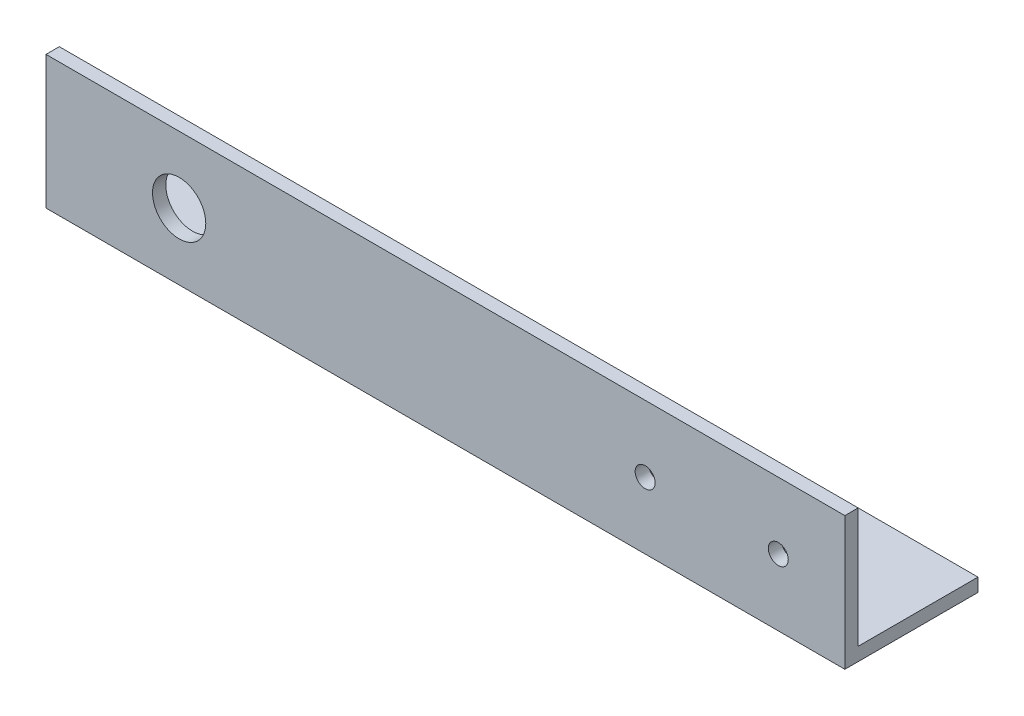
ISO-10303-21;
HEADER;
FILE_DESCRIPTION(('STEP AP214'),'2;1');
FILE_NAME('part.step','',(''),(''),'','','');
FILE_SCHEMA(('AUTOMOTIVE_DESIGN { 1 0 10303 214 1 1 1 1 }'));
ENDSEC;
DATA;
#1=APPLICATION_CONTEXT('core data for automotive mechanical design processes');
#2=APPLICATION_PROTOCOL_DEFINITION('international standard','automotive_design',2000,#1);
#3=PRODUCT_CONTEXT('',#1,'mechanical');
#4=PRODUCT('Part','Part','',(#3));
#5=PRODUCT_RELATED_PRODUCT_CATEGORY('part','',(#4));
#6=PRODUCT_DEFINITION_FORMATION('','',#4);
#7=PRODUCT_DEFINITION_CONTEXT('part definition',#1,'design');
#8=PRODUCT_DEFINITION('design','',#6,#7);
#9=PRODUCT_DEFINITION_SHAPE('','',#8);
#10=(LENGTH_UNIT() NAMED_UNIT(*) SI_UNIT(.MILLI.,.METRE.));
#11=(NAMED_UNIT(*) PLANE_ANGLE_UNIT() SI_UNIT($,.RADIAN.));
#12=(NAMED_UNIT(*) SI_UNIT($,.STERADIAN.) SOLID_ANGLE_UNIT());
#13=UNCERTAINTY_MEASURE_WITH_UNIT(LENGTH_MEASURE(1.E-05),#10,'distance_accuracy_value','');
#14=(GEOMETRIC_REPRESENTATION_CONTEXT(3) GLOBAL_UNCERTAINTY_ASSIGNED_CONTEXT((#13)) GLOBAL_UNIT_ASSIGNED_CONTEXT((#10,
#11,#12)) REPRESENTATION_CONTEXT('',''));
#15=CARTESIAN_POINT('',(0.,0.,0.));
#16=DIRECTION('',(0.,0.,1.));
#17=DIRECTION('',(1.,0.,0.));
#18=AXIS2_PLACEMENT_3D('',#15,#16,#17);
#19=CARTESIAN_POINT('',(120.,0.,-20.));
#20=DIRECTION('',(0.,1.,0.));
#21=DIRECTION('',(0.,0.,1.));
#22=AXIS2_PLACEMENT_3D('',#19,#20,#21);
#23=PLANE('',#22);
#24=DIRECTION('',(0.,0.,-1.));
#25=VECTOR('',#24,1.);
#26=CARTESIAN_POINT('',(0.,0.,-20.));
#27=LINE('',#26,#25);
#28=CARTESIAN_POINT('',(0.,0.,0.));
#29=VERTEX_POINT('',#28);
#30=CARTESIAN_POINT('',(0.,0.,-20.));
#31=VERTEX_POINT('',#30);
#32=EDGE_CURVE('E115',#29,#31,#27,.T.);
#33=ORIENTED_EDGE('',*,*,#32,.T.);
#34=DIRECTION('',(-1.,0.,0.));
#35=VECTOR('',#34,1.);
#36=CARTESIAN_POINT('',(120.,0.,-20.));
#37=LINE('',#36,#35);
#38=CARTESIAN_POINT('',(120.,0.,-20.));
#39=VERTEX_POINT('',#38);
#40=EDGE_CURVE('E11',#39,#31,#37,.T.);
#41=ORIENTED_EDGE('',*,*,#40,.F.);
#42=DIRECTION('',(0.,0.,-1.));
#43=VECTOR('',#42,1.);
#44=CARTESIAN_POINT('',(120.,0.,-20.));
#45=LINE('',#44,#43);
#46=CARTESIAN_POINT('',(120.,0.,0.));
#47=VERTEX_POINT('',#46);
#48=EDGE_CURVE('E126',#47,#39,#45,.T.);
#49=ORIENTED_EDGE('',*,*,#48,.F.);
#50=DIRECTION('',(-1.,0.,0.));
#51=VECTOR('',#50,1.);
#52=CARTESIAN_POINT('',(120.,0.,0.));
#53=LINE('',#52,#51);
#54=EDGE_CURVE('E111',#47,#29,#53,.T.);
#55=ORIENTED_EDGE('',*,*,#54,.T.);
#56=EDGE_LOOP('',(#33,#41,#49,#55));
#57=FACE_BOUND('',#56,.T.);
#58=ADVANCED_FACE('F31',(#57),#23,.F.);
#59=CARTESIAN_POINT('',(120.,2.,-20.));
#60=DIRECTION('',(0.,0.,1.));
#61=DIRECTION('',(1.,0.,0.));
#62=AXIS2_PLACEMENT_3D('',#59,#60,#61);
#63=PLANE('',#62);
#64=DIRECTION('',(0.,1.,0.));
#65=VECTOR('',#64,1.);
#66=CARTESIAN_POINT('',(0.,2.,-20.));
#67=LINE('',#66,#65);
#68=CARTESIAN_POINT('',(0.,2.,-20.));
#69=VERTEX_POINT('',#68);
#70=EDGE_CURVE('E118',#31,#69,#67,.T.);
#71=ORIENTED_EDGE('',*,*,#70,.T.);
#72=DIRECTION('',(-1.,0.,0.));
#73=VECTOR('',#72,1.);
#74=CARTESIAN_POINT('',(120.,2.,-20.));
#75=LINE('',#74,#73);
#76=CARTESIAN_POINT('',(120.,2.,-20.));
#77=VERTEX_POINT('',#76);
#78=EDGE_CURVE('E39',#77,#69,#75,.T.);
#79=ORIENTED_EDGE('',*,*,#78,.F.);
#80=DIRECTION('',(0.,1.,0.));
#81=VECTOR('',#80,1.);
#82=CARTESIAN_POINT('',(120.,2.,-20.));
#83=LINE('',#82,#81);
#84=EDGE_CURVE('E84',#39,#77,#83,.T.);
#85=ORIENTED_EDGE('',*,*,#84,.F.);
#86=ORIENTED_EDGE('',*,*,#40,.T.);
#87=EDGE_LOOP('',(#71,#79,#85,#86));
#88=FACE_BOUND('',#87,.T.);
#89=ADVANCED_FACE('F153',(#88),#63,.F.);
#90=CARTESIAN_POINT('',(120.,2.,-2.));
#91=DIRECTION('',(0.,-1.,0.));
#92=DIRECTION('',(0.,0.,-1.));
#93=AXIS2_PLACEMENT_3D('',#90,#91,#92);
#94=PLANE('',#93);
#95=DIRECTION('',(0.,0.,1.));
#96=VECTOR('',#95,1.);
#97=CARTESIAN_POINT('',(0.,2.,-2.));
#98=LINE('',#97,#96);
#99=CARTESIAN_POINT('',(0.,2.,-2.));
#100=VERTEX_POINT('',#99);
#101=EDGE_CURVE('E121',#69,#100,#98,.T.);
#102=ORIENTED_EDGE('',*,*,#101,.T.);
#103=DIRECTION('',(-1.,0.,0.));
#104=VECTOR('',#103,1.);
#105=CARTESIAN_POINT('',(120.,2.,-2.));
#106=LINE('',#105,#104);
#107=CARTESIAN_POINT('',(120.,2.,-2.));
#108=VERTEX_POINT('',#107);
#109=EDGE_CURVE('E106',#108,#100,#106,.T.);
#110=ORIENTED_EDGE('',*,*,#109,.F.);
#111=DIRECTION('',(0.,0.,1.));
#112=VECTOR('',#111,1.);
#113=CARTESIAN_POINT('',(120.,2.,-2.));
#114=LINE('',#113,#112);
#115=EDGE_CURVE('E97',#77,#108,#114,.T.);
#116=ORIENTED_EDGE('',*,*,#115,.F.);
#117=ORIENTED_EDGE('',*,*,#78,.T.);
#118=EDGE_LOOP('',(#102,#110,#116,#117));
#119=FACE_BOUND('',#118,.T.);
#120=ADVANCED_FACE('F132',(#119),#94,.F.);
#121=CARTESIAN_POINT('',(120.,20.,-2.));
#122=DIRECTION('',(0.,0.,1.));
#123=DIRECTION('',(0.,-1.,0.));
#124=AXIS2_PLACEMENT_3D('',#121,#122,#123);
#125=PLANE('',#124);
#126=CARTESIAN_POINT('',(110.,10.,-2.));
#127=DIRECTION('',(0.,0.,1.));
#128=DIRECTION('',(0.,-1.,0.));
#129=AXIS2_PLACEMENT_3D('',#126,#127,#128);
#130=CIRCLE('',#129,1.5);
#131=CARTESIAN_POINT('',(110.,8.5,-2.));
#132=VERTEX_POINT('',#131);
#133=EDGE_CURVE('E169',#132,#132,#130,.T.);
#134=ORIENTED_EDGE('',*,*,#133,.T.);
#135=EDGE_LOOP('',(#134));
#136=FACE_BOUND('',#135,.T.);
#137=CARTESIAN_POINT('',(90.,9.99999999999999,-2.));
#138=DIRECTION('',(0.,0.,1.));
#139=DIRECTION('',(0.,-1.,0.));
#140=AXIS2_PLACEMENT_3D('',#137,#138,#139);
#141=CIRCLE('',#140,1.5);
#142=CARTESIAN_POINT('',(90.,8.5,-2.));
#143=VERTEX_POINT('',#142);
#144=EDGE_CURVE('E173',#143,#143,#141,.T.);
#145=ORIENTED_EDGE('',*,*,#144,.T.);
#146=EDGE_LOOP('',(#145));
#147=FACE_BOUND('',#146,.T.);
#148=CARTESIAN_POINT('',(20.,10.,-2.));
#149=DIRECTION('',(0.,0.,1.));
#150=DIRECTION('',(0.,-1.,0.));
#151=AXIS2_PLACEMENT_3D('',#148,#149,#150);
#152=CIRCLE('',#151,4.);
#153=CARTESIAN_POINT('',(20.,6.,-2.));
#154=VERTEX_POINT('',#153);
#155=EDGE_CURVE('E119',#154,#154,#152,.T.);
#156=ORIENTED_EDGE('',*,*,#155,.T.);
#157=EDGE_LOOP('',(#156));
#158=FACE_BOUND('',#157,.T.);
#159=DIRECTION('',(0.,1.,0.));
#160=VECTOR('',#159,1.);
#161=CARTESIAN_POINT('',(0.,20.,-2.));
#162=LINE('',#161,#160);
#163=CARTESIAN_POINT('',(0.,20.,-2.));
#164=VERTEX_POINT('',#163);
#165=EDGE_CURVE('E105',#100,#164,#162,.T.);
#166=ORIENTED_EDGE('',*,*,#165,.T.);
#167=DIRECTION('',(-1.,0.,0.));
#168=VECTOR('',#167,1.);
#169=CARTESIAN_POINT('',(120.,20.,-2.));
#170=LINE('',#169,#168);
#171=CARTESIAN_POINT('',(120.,20.,-2.));
#172=VERTEX_POINT('',#171);
#173=EDGE_CURVE('E102',#172,#164,#170,.T.);
#174=ORIENTED_EDGE('',*,*,#173,.F.);
#175=DIRECTION('',(0.,1.,0.));
#176=VECTOR('',#175,1.);
#177=CARTESIAN_POINT('',(120.,20.,-2.));
#178=LINE('',#177,#176);
#179=EDGE_CURVE('E91',#108,#172,#178,.T.);
#180=ORIENTED_EDGE('',*,*,#179,.F.);
#181=ORIENTED_EDGE('',*,*,#109,.T.);
#182=EDGE_LOOP('',(#166,#174,#180,#181));
#183=FACE_BOUND('',#182,.T.);
#184=ADVANCED_FACE('F103',(#136,#147,#158,#183),#125,.F.);
#185=CARTESIAN_POINT('',(120.,20.,0.));
#186=DIRECTION('',(0.,-1.,0.));
#187=DIRECTION('',(0.,0.,-1.));
#188=AXIS2_PLACEMENT_3D('',#185,#186,#187);
#189=PLANE('',#188);
#190=DIRECTION('',(0.,0.,1.));
#191=VECTOR('',#190,1.);
#192=CARTESIAN_POINT('',(0.,20.,0.));
#193=LINE('',#192,#191);
#194=CARTESIAN_POINT('',(0.,20.,0.));
#195=VERTEX_POINT('',#194);
#196=EDGE_CURVE('E70',#164,#195,#193,.T.);
#197=ORIENTED_EDGE('',*,*,#196,.T.);
#198=DIRECTION('',(-1.,0.,0.));
#199=VECTOR('',#198,1.);
#200=CARTESIAN_POINT('',(120.,20.,0.));
#201=LINE('',#200,#199);
#202=CARTESIAN_POINT('',(120.,20.,0.));
#203=VERTEX_POINT('',#202);
#204=EDGE_CURVE('E107',#203,#195,#201,.T.);
#205=ORIENTED_EDGE('',*,*,#204,.F.);
#206=DIRECTION('',(0.,0.,1.));
#207=VECTOR('',#206,1.);
#208=CARTESIAN_POINT('',(120.,20.,0.));
#209=LINE('',#208,#207);
#210=EDGE_CURVE('E95',#172,#203,#209,.T.);
#211=ORIENTED_EDGE('',*,*,#210,.F.);
#212=ORIENTED_EDGE('',*,*,#173,.T.);
#213=EDGE_LOOP('',(#197,#205,#211,#212));
#214=FACE_BOUND('',#213,.T.);
#215=ADVANCED_FACE('F109',(#214),#189,.F.);
#216=CARTESIAN_POINT('',(120.,0.,0.));
#217=DIRECTION('',(0.,0.,-1.));
#218=DIRECTION('',(-1.,0.,0.));
#219=AXIS2_PLACEMENT_3D('',#216,#217,#218);
#220=PLANE('',#219);
#221=CARTESIAN_POINT('',(110.,10.,0.));
#222=DIRECTION('',(0.,0.,1.));
#223=DIRECTION('',(1.,0.,0.));
#224=AXIS2_PLACEMENT_3D('',#221,#222,#223);
#225=CIRCLE('',#224,1.5);
#226=CARTESIAN_POINT('',(111.5,10.,0.));
#227=VERTEX_POINT('',#226);
#228=EDGE_CURVE('E189',#227,#227,#225,.T.);
#229=ORIENTED_EDGE('',*,*,#228,.F.);
#230=EDGE_LOOP('',(#229));
#231=FACE_BOUND('',#230,.T.);
#232=CARTESIAN_POINT('',(90.,9.99999999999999,0.));
#233=DIRECTION('',(0.,0.,1.));
#234=DIRECTION('',(1.,0.,0.));
#235=AXIS2_PLACEMENT_3D('',#232,#233,#234);
#236=CIRCLE('',#235,1.5);
#237=CARTESIAN_POINT('',(91.5,9.99999999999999,0.));
#238=VERTEX_POINT('',#237);
#239=EDGE_CURVE('E185',#238,#238,#236,.T.);
#240=ORIENTED_EDGE('',*,*,#239,.F.);
#241=EDGE_LOOP('',(#240));
#242=FACE_BOUND('',#241,.T.);
#243=CARTESIAN_POINT('',(20.,10.,0.));
#244=DIRECTION('',(0.,0.,1.));
#245=DIRECTION('',(1.,0.,0.));
#246=AXIS2_PLACEMENT_3D('',#243,#244,#245);
#247=CIRCLE('',#246,4.);
#248=CARTESIAN_POINT('',(24.,10.,0.));
#249=VERTEX_POINT('',#248);
#250=EDGE_CURVE('E177',#249,#249,#247,.T.);
#251=ORIENTED_EDGE('',*,*,#250,.F.);
#252=EDGE_LOOP('',(#251));
#253=FACE_BOUND('',#252,.T.);
#254=DIRECTION('',(0.,-1.,0.));
#255=VECTOR('',#254,1.);
#256=CARTESIAN_POINT('',(0.,0.,0.));
#257=LINE('',#256,#255);
#258=EDGE_CURVE('E76',#195,#29,#257,.T.);
#259=ORIENTED_EDGE('',*,*,#258,.T.);
#260=ORIENTED_EDGE('',*,*,#54,.F.);
#261=DIRECTION('',(0.,-1.,0.));
#262=VECTOR('',#261,1.);
#263=CARTESIAN_POINT('',(120.,0.,0.));
#264=LINE('',#263,#262);
#265=EDGE_CURVE('E47',#203,#47,#264,.T.);
#266=ORIENTED_EDGE('',*,*,#265,.F.);
#267=ORIENTED_EDGE('',*,*,#204,.T.);
#268=EDGE_LOOP('',(#259,#260,#266,#267));
#269=FACE_BOUND('',#268,.T.);
#270=ADVANCED_FACE('F139',(#231,#242,#253,#269),#220,.F.);
#271=CARTESIAN_POINT('',(120.,0.,0.));
#272=DIRECTION('',(-1.,0.,0.));
#273=DIRECTION('',(0.,0.,1.));
#274=AXIS2_PLACEMENT_3D('',#271,#272,#273);
#275=PLANE('',#274);
#276=ORIENTED_EDGE('',*,*,#48,.T.);
#277=ORIENTED_EDGE('',*,*,#84,.T.);
#278=ORIENTED_EDGE('',*,*,#115,.T.);
#279=ORIENTED_EDGE('',*,*,#179,.T.);
#280=ORIENTED_EDGE('',*,*,#210,.T.);
#281=ORIENTED_EDGE('',*,*,#265,.T.);
#282=EDGE_LOOP('',(#276,#277,#278,#279,#280,#281));
#283=FACE_BOUND('',#282,.T.);
#284=ADVANCED_FACE('F93',(#283),#275,.F.);
#285=CARTESIAN_POINT('',(0.,0.,0.));
#286=DIRECTION('',(-1.,0.,0.));
#287=DIRECTION('',(0.,0.,1.));
#288=AXIS2_PLACEMENT_3D('',#285,#286,#287);
#289=PLANE('',#288);
#290=ORIENTED_EDGE('',*,*,#32,.F.);
#291=ORIENTED_EDGE('',*,*,#258,.F.);
#292=ORIENTED_EDGE('',*,*,#196,.F.);
#293=ORIENTED_EDGE('',*,*,#165,.F.);
#294=ORIENTED_EDGE('',*,*,#101,.F.);
#295=ORIENTED_EDGE('',*,*,#70,.F.);
#296=EDGE_LOOP('',(#290,#291,#292,#293,#294,#295));
#297=FACE_BOUND('',#296,.T.);
#298=ADVANCED_FACE('F135',(#297),#289,.T.);
#299=CARTESIAN_POINT('',(20.,10.,-20.));
#300=DIRECTION('',(0.,0.,1.));
#301=DIRECTION('',(1.,0.,0.));
#302=AXIS2_PLACEMENT_3D('',#299,#300,#301);
#303=CYLINDRICAL_SURFACE('',#302,4.);
#304=ORIENTED_EDGE('',*,*,#250,.T.);
#305=EDGE_LOOP('',(#304));
#306=FACE_BOUND('',#305,.T.);
#307=ORIENTED_EDGE('',*,*,#155,.F.);
#308=EDGE_LOOP('',(#307));
#309=FACE_BOUND('',#308,.T.);
#310=ADVANCED_FACE('F200',(#306,#309),#303,.F.);
#311=CARTESIAN_POINT('',(90.,9.99999999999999,-20.));
#312=DIRECTION('',(0.,0.,1.));
#313=DIRECTION('',(1.,0.,0.));
#314=AXIS2_PLACEMENT_3D('',#311,#312,#313);
#315=CYLINDRICAL_SURFACE('',#314,1.5);
#316=ORIENTED_EDGE('',*,*,#239,.T.);
#317=EDGE_LOOP('',(#316));
#318=FACE_BOUND('',#317,.T.);
#319=ORIENTED_EDGE('',*,*,#144,.F.);
#320=EDGE_LOOP('',(#319));
#321=FACE_BOUND('',#320,.T.);
#322=ADVANCED_FACE('F195',(#318,#321),#315,.F.);
#323=CARTESIAN_POINT('',(110.,10.,-20.));
#324=DIRECTION('',(0.,0.,1.));
#325=DIRECTION('',(1.,0.,0.));
#326=AXIS2_PLACEMENT_3D('',#323,#324,#325);
#327=CYLINDRICAL_SURFACE('',#326,1.5);
#328=ORIENTED_EDGE('',*,*,#228,.T.);
#329=EDGE_LOOP('',(#328));
#330=FACE_BOUND('',#329,.T.);
#331=ORIENTED_EDGE('',*,*,#133,.F.);
#332=EDGE_LOOP('',(#331));
#333=FACE_BOUND('',#332,.T.);
#334=ADVANCED_FACE('F192',(#330,#333),#327,.F.);
#335=CLOSED_SHELL('',(#58,#89,#120,#184,#215,#270,#284,#298,#310,#322,#334));
#336=MANIFOLD_SOLID_BREP('B2',#335);
#337=ADVANCED_BREP_SHAPE_REPRESENTATION('',(#18,#336),#14);
#338=SHAPE_DEFINITION_REPRESENTATION(#9,#337);
ENDSEC;
END-ISO-10303-21;
